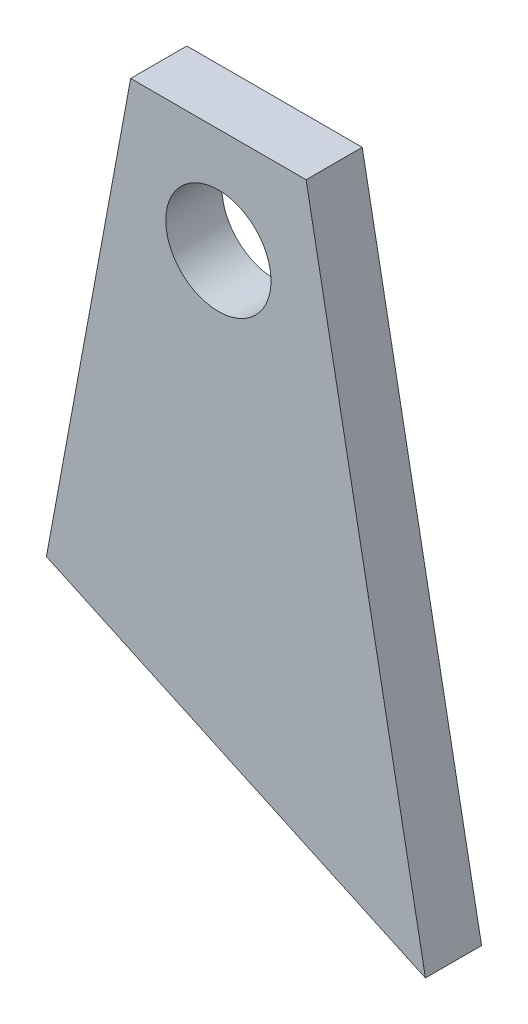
from build123d import *

# Parameters (mm, degrees)
SKETCH_1_R      = 15
EXTRUDE_1_DEPTH = 16


with BuildPart() as part:
    # Sketch 1 → Extrude 1 (new body)
    with BuildSketch(Plane.XY):
        Polygon((-25, 0), (25, 0), (59, -180), (-49, -130), align=None)
        with Locations((0, -30)):
            Circle(SKETCH_1_R, mode=Mode.SUBTRACT)
    extrude(amount=EXTRUDE_1_DEPTH)


solid = part.part
